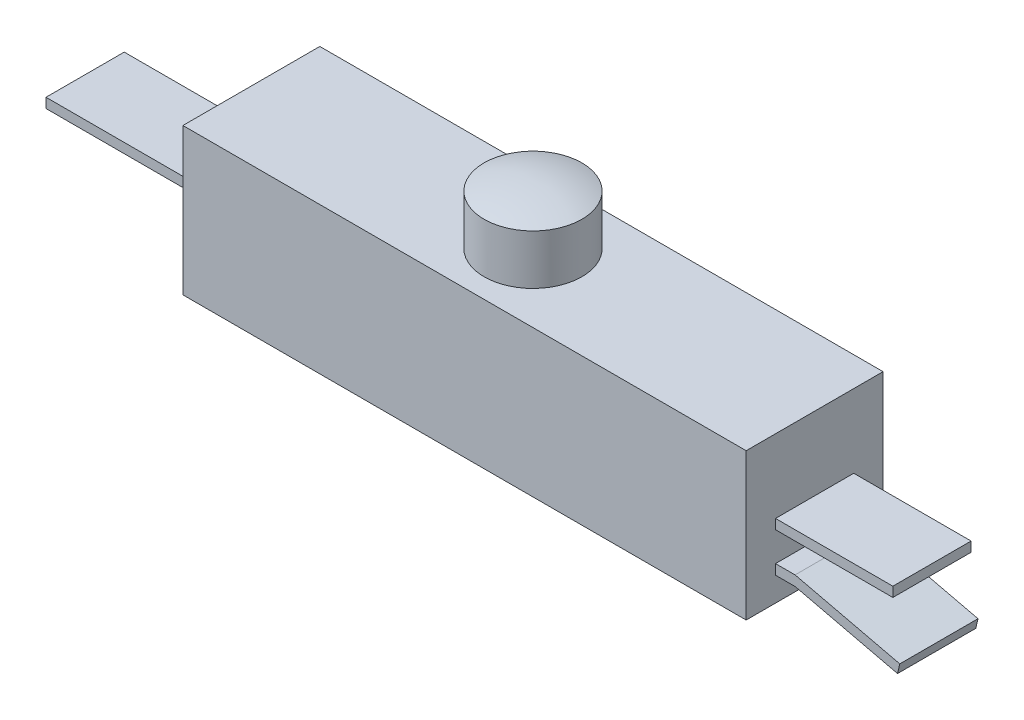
from build123d import *

# Parameters (mm, degrees)
SKETCH1_W                = 45.72
SKETCH1_H                = 11.1125
BOSS_EXTRUDE1_DEPTH      = 11.90625
SKETCH2_R                = 3.96875
BOSS_EXTRUDE2_DEPTH      = 4.7625
BOSS_EXTRUDE3_DEPTH      = 3.175
BOSS_EXTRUDE3_DEPTH_BACK = 3.175
SKETCH4_W                = 13.49375
SKETCH4_H                = 0.79375
SKETCH4_W_2              = 9.525


with BuildPart() as part:
    # Sketch1 → Boss-Extrude1 (new body)
    with BuildSketch(Plane(origin=(0, 0, 0), x_dir=(1, 0, 0), z_dir=(0, 1, 0))):
        Rectangle(SKETCH1_W, SKETCH1_H)
    extrude(amount=BOSS_EXTRUDE1_DEPTH)

    # Sketch2 → Boss-Extrude2 (add)
    with BuildSketch(Plane(origin=(0, 11.90625, 0), x_dir=(1, 0, 0), z_dir=(0, 1, 0))):
        with Locations(Location((0, 0, 0), (0, 0, 90))):
            Circle(SKETCH2_R)
    extrude(amount=BOSS_EXTRUDE2_DEPTH)

    # Sketch3 → Cut-Revolve15 (revolve, cut)
    with BuildSketch(Plane.XY, mode=Mode.PRIVATE) as cut_revolve15_sk:
        with BuildLine():
            ThreePointArc((0, 16.66875), (-2.117156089, 16.468537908), (-4.15925, 15.875))
            Line((-4.15925, 15.875), (-4.15925, 17.145))
            Line((-4.15925, 17.145), (0, 17.145))
            Line((0, 17.145), (0, 16.66875))
        make_face()
    revolve(cut_revolve15_sk.sketch.rotate(Axis((0, 11.90625, 0), (0, 1, 0)), 270), axis=Axis((0, 11.90625, 0), (0, 1, 0)), mode=Mode.SUBTRACT)

    # Sketch4 → Boss-Extrude3 (add, two sides: drawn at the far end of the back side and taken through both)
    with BuildSketch(Plane.XY.offset(-BOSS_EXTRUDE3_DEPTH_BACK)):
        Polygon((24.265172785, 2.00559937), (24.4475, 2.778125), (22.86, 2.778125), (22.86, 1.962567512), (24.4475, 1.962567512), align=None)
        Polygon((32.94528193, 0.77252563), (24.4475, 2.778125), (24.4475, 1.962567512), (32.762954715, 0), align=None)
        Polygon((24.4475, 1.962567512), (24.4475, 2.778125), (24.265172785, 2.00559937), align=None)
        with Locations((-29.606875, 5.55625)):
            Rectangle(SKETCH4_W, SKETCH4_H)
        with Locations((27.6225, 5.55625)):
            Rectangle(SKETCH4_W_2, SKETCH4_H)
    extrude(amount=BOSS_EXTRUDE3_DEPTH + BOSS_EXTRUDE3_DEPTH_BACK)


solid = part.part
